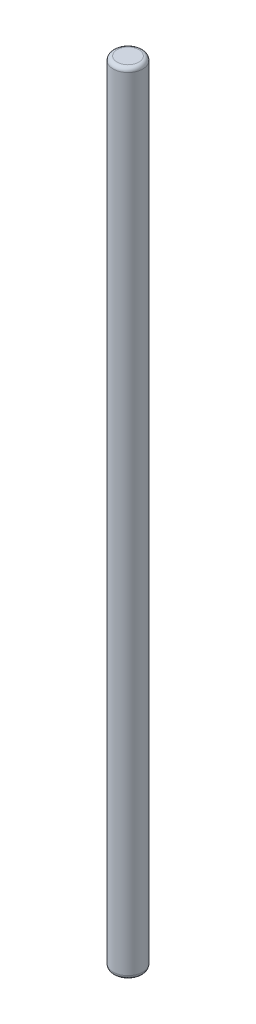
from build123d import *

# Parameters (mm, degrees)
ESTRUSIONE_ESTRUSIONE1_DEPTH      = 20
ESTRUSIONE_ESTRUSIONE1_DEPTH_BACK = 20
SCHIZZO1_R                        = 0.75
RACCORDO1_R                       = 0.2


with BuildPart() as part:
    # Schizzo1 → Estrusione-Estrusione1 (new, two sides: drawn at the far end of the back side and taken through both)
    with BuildSketch(Plane(origin=(0, 0, 0), x_dir=(1, 0, 0), z_dir=(0, 1, 0)).offset(-ESTRUSIONE_ESTRUSIONE1_DEPTH_BACK)):
        with Locations(Location((0, 0, 0), (0, 0, 270))):
            Circle(SCHIZZO1_R)
    extrude(amount=ESTRUSIONE_ESTRUSIONE1_DEPTH + ESTRUSIONE_ESTRUSIONE1_DEPTH_BACK)

    # Raccordo1
    raccordo1_edges = [part.edges().sort_by_distance(p)[0] for p in [
        (0, 20, -0.75),
        (0, -20, -0.75),
    ]]
    fillet(raccordo1_edges, radius=RACCORDO1_R)


solid = part.part
